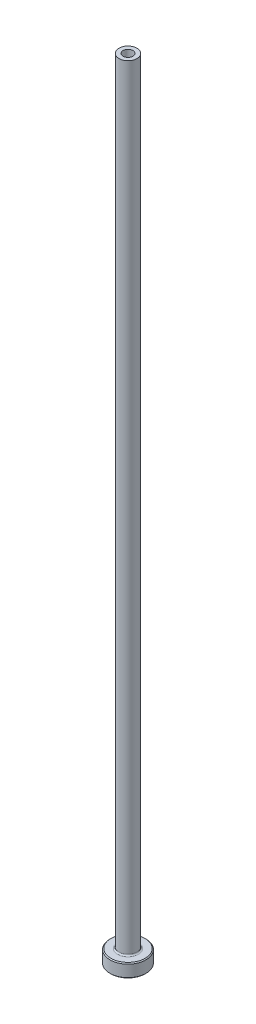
from build123d import *

# Parameters (mm, degrees)
FILLET1_R     = 0.3
CHAMFER1_SIZE = 0.2
CHAMFER3_SIZE = 0.5


with BuildPart() as part:
    # Sketch1 → Revolve1 (revolve)
    with BuildSketch(Plane.XY, mode=Mode.PRIVATE) as revolve1_sk:
        Polygon((-1.1, 175), (-2, 175), (-2, 3), (-4, 3), (-4, 0), (-1.35, 0), (-1.35, 128), (-1.1, 140), align=None)
    revolve(revolve1_sk.sketch.rotate(Axis((0, 92.187680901, 0), (0, -1, 0)), 270), axis=Axis((0, 92.187680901, 0), (0, -1, 0)))

    # Fillet1
    fillet1_edges = [part.edges().sort_by_distance(p)[0] for p in [
        (0, 3, -2),
    ]]
    fillet(fillet1_edges, radius=FILLET1_R)

    # Chamfer1
    chamfer1_edges = [part.edges().sort_by_distance(p)[0] for p in [
        (0, 0, -4),
        (0, 3, -4),
    ]]
    chamfer(chamfer1_edges, length=CHAMFER1_SIZE)

    # Chamfer3
    chamfer3_edges = [part.edges().sort_by_distance(p)[0] for p in [
        (0, 0, -1.35),
    ]]
    chamfer(chamfer3_edges, length=CHAMFER3_SIZE)


solid = part.part
